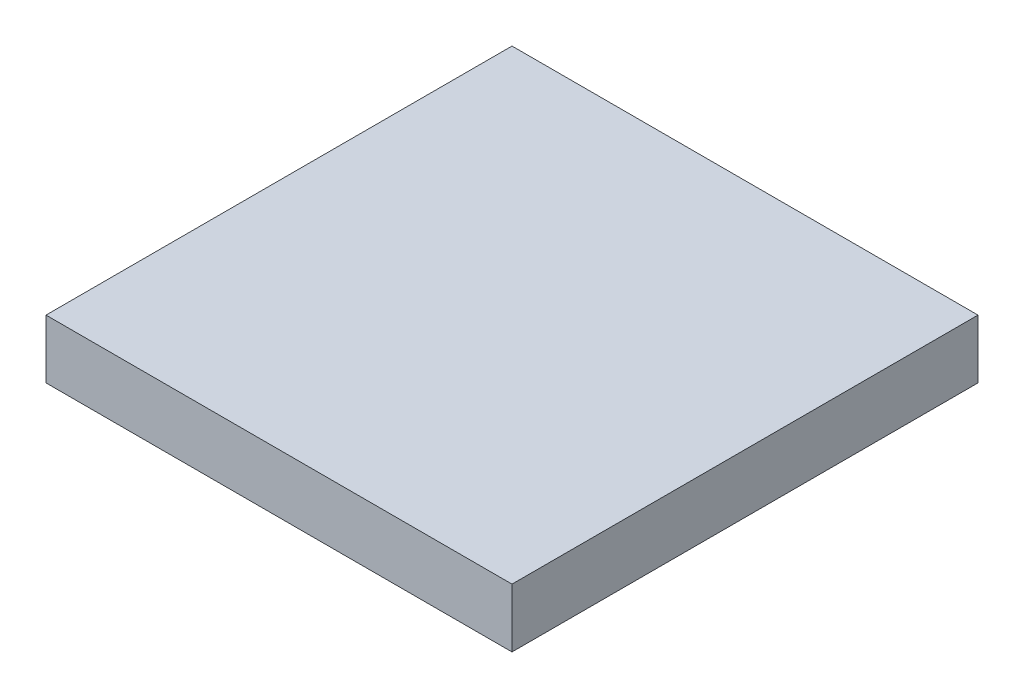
from build123d import *

# Parameters (mm, degrees)
SKIZZE1_W               = 100
SKIZZE1_H               = 12.609025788
LINEAR_AUSTRAGEN1_DEPTH = 50


with BuildPart() as part:
    # Skizze1 → Linear austragen1 (new, symmetric)
    with BuildSketch(Plane.XY):
        with Locations((50, 6.304512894)):
            Rectangle(SKIZZE1_W, SKIZZE1_H)
    extrude(amount=LINEAR_AUSTRAGEN1_DEPTH, both=True)


solid = part.part
